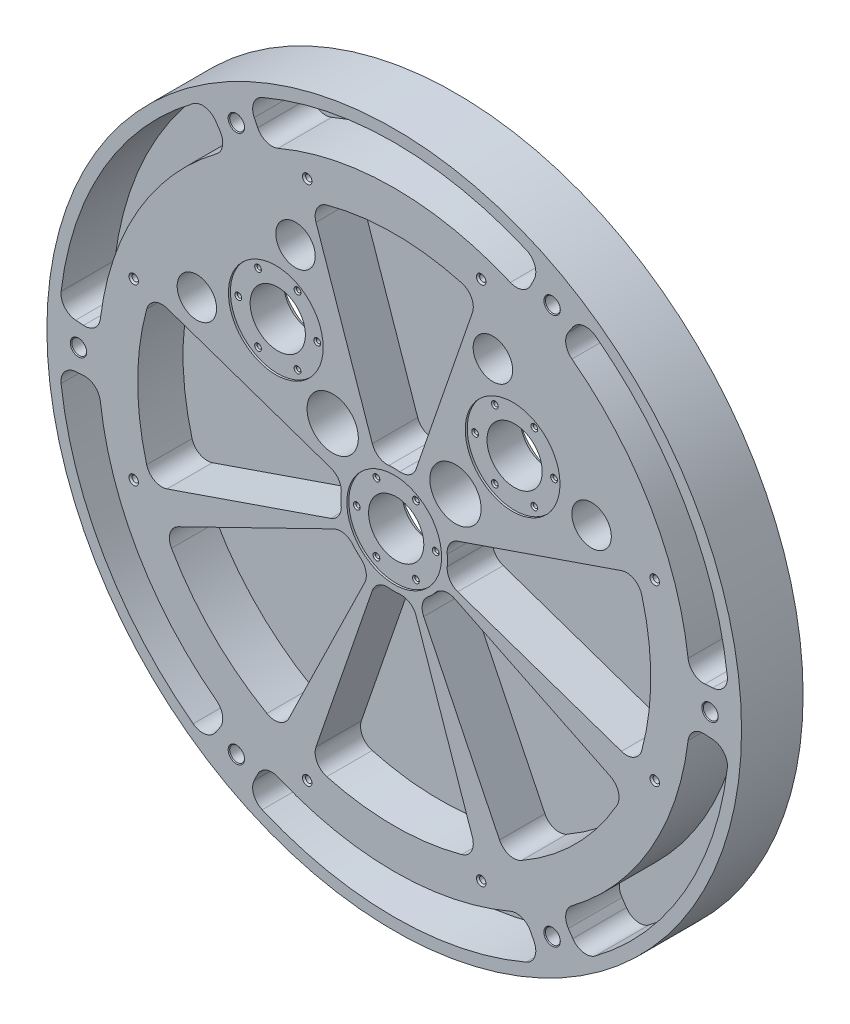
from build123d import *

# Parameters (mm, degrees)
SKETCH1_R                                 = 279.4
BOSS_EXTRUDE1_DEPTH                       = 50.8
SKETCH7_R                                 = 203.2
FDL_CART_RELEIF_DEPTH                     = 9.525
CENETER_SIGHT_THRU_HOLE_DEPTH             = 399.38343339
CENETER_SIGHT_THRU_HOLE_DEPTH_BACK        = 399.38343339
SKETCH9_R                                 = 22.225
SKETCH10_R                                = 38.1
CENTER_SIGHT_SPOT_FACE_DEPTH              = 1.5875
CENTER_SIGHT_BOLT_CIRCLE_D                = 3.4544
CENTER_SIGHT_BOLT_CIRCLE_DEPTH            = 14.837193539
CENTER_SIGHT_BOLT_CIRCLE_CSINK_D          = 5.4356
CENTER_SIGHT_BOLT_CIRCLE_CSINK_ANGLE      = 90
CENTER_SIGHT_BOLT_CIRCLE_TIP              = 1.037806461
SKETCH32_R                                = 22.225
UPPER_SIGHT_THRU_HOLES_DEPTH              = 399.38343339
SKETCH33_R                                = 38.1
UPPER_SIGHT_SPOT_FACE_DEPTH               = 1.5875
PERIMETER_POCKETS_DEPTH                   = 43.18
SKETCH44_R                                = 20.6375
INNER_CIRCLE_CUTS_DEPTH                   = 38.1
BACK_START                                = -12.7
SKETCH45_R                                = 38.1
BACK_WINDOW_POCKETING_DEPTH               = 12.7
F_1_4_20_HANDLE_HOLES_PLACE_1_D           = 5.1054
F_1_4_20_HANDLE_HOLES_PLACE_1_DEPTH       = 14.468183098
F_1_4_20_HANDLE_HOLES_PLACE_1_CSINK_D     = 7.62
F_1_4_20_HANDLE_HOLES_PLACE_1_CSINK_ANGLE = 90
F_1_4_20_HANDLE_HOLES_PLACE_1_TIP         = 1.533816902
F_1_4_20_HANDLE_HOLES_PLACE_3_D           = 5.1054
F_1_4_20_HANDLE_HOLES_PLACE_3_DEPTH       = 14.976183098
F_1_4_20_HANDLE_HOLES_PLACE_3_CSINK_D     = 7.62
F_1_4_20_HANDLE_HOLES_PLACE_3_CSINK_ANGLE = 90
F_1_4_20_HANDLE_HOLES_PLACE_3_TIP         = 1.533816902
SKETCH52_R                                = 398.165433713
CUT_EXTRUDE5_DEPTH                        = 3.175
F_8_32_TAPPED_HOLE1_D                     = 3.4544
F_8_32_TAPPED_HOLE1_DEPTH                 = 14.964193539
F_8_32_TAPPED_HOLE1_CSINK_D               = 5.4356
F_8_32_TAPPED_HOLE1_CSINK_ANGLE           = 90
F_8_32_TAPPED_HOLE1_TIP                   = 1.037806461
F_8_32_TAPPED_HOLE2_D                     = 3.4544
F_8_32_TAPPED_HOLE2_DEPTH                 = 14.964193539
F_8_32_TAPPED_HOLE2_CSINK_D               = 5.4356
F_8_32_TAPPED_HOLE2_CSINK_ANGLE           = 90
F_8_32_TAPPED_HOLE2_TIP                   = 1.037806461
LARGE_PEDALS_DEPTH                        = 36.5125
SKETCH63_R                                = 15.875
CUT_EXTRUDE9_DEPTH                        = 38.1
BOSS_EXTRUDE2_START                       = 1.905
SKETCH65_R                                = 279.4
SKETCH65_R_2                              = 203.2
BOSS_EXTRUDE2_DEPTH                       = 1.905
F_15_32_0_46875_DIAMETER_HOLE1_AT_2_COUNT = 2
F_15_32_0_46875_DIAMETER_HOLE1_AT_2_PITCH = 254
F_15_32_0_46875_DIAMETER_HOLE1_AT_3_COUNT = 2
F_15_32_0_46875_DIAMETER_HOLE1_AT_3_PITCH = 439.940905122
F_15_32_0_46875_DIAMETER_HOLE1_AT_4_COUNT = 2
F_15_32_0_46875_DIAMETER_HOLE1_AT_4_PITCH = 508
F_15_32_0_46875_DIAMETER_HOLE1_AT_5_COUNT = 2
F_15_32_0_46875_DIAMETER_HOLE1_AT_5_PITCH = 439.940905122
F_15_32_0_46875_DIAMETER_HOLE1_AT_6_COUNT = 2
F_15_32_0_46875_DIAMETER_HOLE1_AT_6_PITCH = 254


with BuildPart() as part:
    # Sketch1 → Boss-Extrude1 (new body)
    with BuildSketch(Plane.XY):
        Circle(SKETCH1_R)
    extrude(amount=BOSS_EXTRUDE1_DEPTH)

    # Sketch7 → FDL Cart Releif (cut)
    with BuildSketch(Plane(origin=(0, 0, 0), x_dir=(-1, 0, 0), z_dir=(0, 0, -1))):
        Circle(SKETCH7_R)
    extrude(amount=-FDL_CART_RELEIF_DEPTH, mode=Mode.SUBTRACT)

    # Sketch9 → ceneter sight thru hole (cut, two sides: drawn at the far end of the back side and taken through both)
    with BuildSketch(Plane.XY.offset(50.8).offset(-CENETER_SIGHT_THRU_HOLE_DEPTH_BACK)):
        Circle(SKETCH9_R)
    extrude(amount=CENETER_SIGHT_THRU_HOLE_DEPTH + CENETER_SIGHT_THRU_HOLE_DEPTH_BACK, mode=Mode.SUBTRACT)

    # Sketch10 → center sight spot face (cut)
    with BuildSketch(Plane.XY.offset(50.8)):
        Circle(SKETCH10_R)
    extrude(amount=-CENTER_SIGHT_SPOT_FACE_DEPTH, mode=Mode.SUBTRACT)

    # center sight bolt circle
    with Locations(Plane.XY.offset(49.2125)):
        with Locations((31.75, 0), (15.875, -27.49630657), (-15.875, -27.49630657), (-31.75, 0), (-15.875, 27.49630657), (15.875, 27.49630657)):
            CounterSinkHole(CENTER_SIGHT_BOLT_CIRCLE_D / 2, CENTER_SIGHT_BOLT_CIRCLE_CSINK_D / 2, depth=CENTER_SIGHT_BOLT_CIRCLE_DEPTH, counter_sink_angle=CENTER_SIGHT_BOLT_CIRCLE_CSINK_ANGLE)
            with Locations((0, 0, -(CENTER_SIGHT_BOLT_CIRCLE_DEPTH + CENTER_SIGHT_BOLT_CIRCLE_TIP / 2))):  # 118° drill point
                Cone(0, CENTER_SIGHT_BOLT_CIRCLE_D / 2, CENTER_SIGHT_BOLT_CIRCLE_TIP, mode=Mode.SUBTRACT)

    # Sketch32 → upper sight thru holes (cut, through all)
    with BuildSketch(Plane.XY.offset(50.8)):
        with Locations((-95.25, 98.425)):
            Circle(SKETCH32_R)
        with Locations((95.25, 98.425)):
            Circle(SKETCH32_R)
    extrude(amount=-UPPER_SIGHT_THRU_HOLES_DEPTH, mode=Mode.SUBTRACT)

    # Sketch33 → upper sight spot face (cut)
    with BuildSketch(Plane.XY.offset(50.8)):
        with Locations((-95.25, 98.425)):
            Circle(SKETCH33_R)
        with Locations((95.25, 98.425)):
            Circle(SKETCH33_R)
    extrude(amount=-UPPER_SIGHT_SPOT_FACE_DEPTH, mode=Mode.SUBTRACT)

    # Sketch38 → Perimeter Pockets (cut)
    with BuildSketch(Plane.XY.offset(50.8)):
        with BuildLine():
            Line((-109.813407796, 225.15085186), (-112.600551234, 230.865342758))
            ThreePointArc((-112.600551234, 230.865342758), (-113.088166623, 240.862696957), (-106.182699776, 248.108343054))
            ThreePointArc((-106.182699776, 248.108343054), (0, 269.875), (106.182699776, 248.108343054))
            ThreePointArc((106.182699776, 248.108343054), (113.088166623, 240.862696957), (112.600551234, 230.865342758))
            Line((112.600551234, 230.865342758), (109.813407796, 225.15085186))
            ThreePointArc((109.813407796, 225.15085186), (102.836212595, 218.818640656), (93.416509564, 219.036232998))
            ThreePointArc((93.416509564, 219.036232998), (0, 238.125), (-93.416509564, 219.036232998))
            ThreePointArc((-93.416509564, 219.036232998), (-102.836212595, 218.818640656), (-109.813407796, 225.15085186))
        make_face()
        with BuildLine():
            Line((140.079653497, 207.676626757), (143.634976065, 212.947609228))
            ThreePointArc((143.634976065, 212.947609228), (152.049131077, 218.368573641), (161.776778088, 216.011086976))
            ThreePointArc((161.776778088, 216.011086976), (233.718605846, 134.9375), (267.959477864, 32.097256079))
            ThreePointArc((267.959477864, 32.097256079), (265.1372977, 22.494123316), (256.235527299, 17.917733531))
            Line((256.235527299, 17.917733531), (249.893061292, 17.474225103))
            ThreePointArc((249.893061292, 17.474225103), (240.920607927, 20.350547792), (236.399196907, 28.617046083))
            ThreePointArc((236.399196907, 28.617046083), (206.222299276, 119.0625), (142.982687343, 190.419186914))
            ThreePointArc((142.982687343, 190.419186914), (138.084395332, 198.468092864), (140.079653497, 207.676626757))
        make_face()
        with BuildLine():
            Line((249.893061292, -17.474225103), (256.235527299, -17.917733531))
            ThreePointArc((256.235527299, -17.917733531), (265.1372977, -22.494123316), (267.959477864, -32.097256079))
            ThreePointArc((267.959477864, -32.097256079), (233.718605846, -134.9375), (161.776778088, -216.011086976))
            ThreePointArc((161.776778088, -216.011086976), (152.049131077, -218.368573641), (143.634976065, -212.947609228))
            Line((143.634976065, -212.947609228), (140.079653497, -207.676626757))
            ThreePointArc((140.079653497, -207.676626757), (138.084395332, -198.468092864), (142.982687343, -190.419186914))
            ThreePointArc((142.982687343, -190.419186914), (206.222299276, -119.0625), (236.399196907, -28.617046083))
            ThreePointArc((236.399196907, -28.617046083), (240.920607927, -20.350547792), (249.893061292, -17.474225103))
        make_face()
        with BuildLine():
            Line((109.813407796, -225.15085186), (112.600551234, -230.865342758))
            ThreePointArc((112.600551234, -230.865342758), (113.088166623, -240.862696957), (106.182699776, -248.108343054))
            ThreePointArc((106.182699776, -248.108343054), (0, -269.875), (-106.182699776, -248.108343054))
            ThreePointArc((-106.182699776, -248.108343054), (-113.088166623, -240.862696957), (-112.600551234, -230.865342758))
            Line((-112.600551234, -230.865342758), (-109.813407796, -225.15085186))
            ThreePointArc((-109.813407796, -225.15085186), (-102.836212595, -218.818640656), (-93.416509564, -219.036232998))
            ThreePointArc((-93.416509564, -219.036232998), (0, -238.125), (93.416509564, -219.036232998))
            ThreePointArc((93.416509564, -219.036232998), (102.836212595, -218.818640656), (109.813407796, -225.15085186))
        make_face()
        with BuildLine():
            Line((-140.079653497, -207.676626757), (-143.634976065, -212.947609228))
            ThreePointArc((-143.634976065, -212.947609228), (-152.049131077, -218.368573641), (-161.776778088, -216.011086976))
            ThreePointArc((-161.776778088, -216.011086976), (-233.718605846, -134.9375), (-267.959477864, -32.097256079))
            ThreePointArc((-267.959477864, -32.097256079), (-265.1372977, -22.494123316), (-256.235527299, -17.917733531))
            Line((-256.235527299, -17.917733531), (-249.893061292, -17.474225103))
            ThreePointArc((-249.893061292, -17.474225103), (-240.920607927, -20.350547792), (-236.399196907, -28.617046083))
            ThreePointArc((-236.399196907, -28.617046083), (-206.222299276, -119.0625), (-142.982687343, -190.419186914))
            ThreePointArc((-142.982687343, -190.419186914), (-138.084395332, -198.468092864), (-140.079653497, -207.676626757))
        make_face()
        with BuildLine():
            Line((-249.893061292, 17.474225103), (-256.235527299, 17.917733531))
            ThreePointArc((-256.235527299, 17.917733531), (-265.1372977, 22.494123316), (-267.959477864, 32.097256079))
            ThreePointArc((-267.959477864, 32.097256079), (-233.718605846, 134.9375), (-161.776778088, 216.011086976))
            ThreePointArc((-161.776778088, 216.011086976), (-152.049131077, 218.368573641), (-143.634976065, 212.947609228))
            Line((-143.634976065, 212.947609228), (-140.079653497, 207.676626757))
            ThreePointArc((-140.079653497, 207.676626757), (-138.084395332, 198.468092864), (-142.982687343, 190.419186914))
            ThreePointArc((-142.982687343, 190.419186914), (-206.222299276, 119.0625), (-236.399196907, 28.617046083))
            ThreePointArc((-236.399196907, 28.617046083), (-240.920607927, 20.350547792), (-249.893061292, 17.474225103))
        make_face()
    extrude(amount=-PERIMETER_POCKETS_DEPTH, mode=Mode.SUBTRACT)

    # Sketch44 → Inner circle Cuts (cut)
    with BuildSketch(Plane.XY.offset(50.8)):
        with Locations((-49.492310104, 49.290300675)):
            Circle(SKETCH44_R)
        with Locations((49.290300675, 49.492310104)):
            Circle(SKETCH44_R)
    extrude(amount=-INNER_CIRCLE_CUTS_DEPTH, mode=Mode.SUBTRACT)

    # Sketch45 → Back Window Pocketing (cut)
    with BuildSketch(Plane(origin=(0, 0, 9.525), x_dir=(-1, 0, 0), z_dir=(0, 0, -1)).offset(BACK_START)):
        with Locations(Location((-95.25, 98.425, 0), (0, 0, 180))):
            Circle(SKETCH45_R)
        with Locations(Location((95.25, 98.425, 0), (0, 0, 180))):
            Circle(SKETCH45_R)
        with Locations(Location((0, 0, 0), (0, 0, 180))):
            Circle(SKETCH45_R)
    extrude(amount=BACK_WINDOW_POCKETING_DEPTH, mode=Mode.SUBTRACT)

    # 1_4-20 Handle Holes Place 1
    with Locations(Plane.XY.offset(50.8)):
        with Locations((-209.55, 69.977), (-209.55, -69.977), (209.55, -69.977), (209.55, 69.977)):
            CounterSinkHole(F_1_4_20_HANDLE_HOLES_PLACE_1_D / 2, F_1_4_20_HANDLE_HOLES_PLACE_1_CSINK_D / 2, depth=F_1_4_20_HANDLE_HOLES_PLACE_1_DEPTH, counter_sink_angle=F_1_4_20_HANDLE_HOLES_PLACE_1_CSINK_ANGLE)
            with Locations((0, 0, -(F_1_4_20_HANDLE_HOLES_PLACE_1_DEPTH + F_1_4_20_HANDLE_HOLES_PLACE_1_TIP / 2))):  # 118° drill point
                Cone(0, F_1_4_20_HANDLE_HOLES_PLACE_1_D / 2, F_1_4_20_HANDLE_HOLES_PLACE_1_TIP, mode=Mode.SUBTRACT)

    # 1_4-20 Handle Holes Place 3
    with Locations(Plane.XY.offset(50.8)):
        with Locations((-69.977, 209.55), (69.977, 209.55), (69.977, -209.55), (-69.977, -209.55)):
            CounterSinkHole(F_1_4_20_HANDLE_HOLES_PLACE_3_D / 2, F_1_4_20_HANDLE_HOLES_PLACE_3_CSINK_D / 2, depth=F_1_4_20_HANDLE_HOLES_PLACE_3_DEPTH, counter_sink_angle=F_1_4_20_HANDLE_HOLES_PLACE_3_CSINK_ANGLE)
            with Locations((0, 0, -(F_1_4_20_HANDLE_HOLES_PLACE_3_DEPTH + F_1_4_20_HANDLE_HOLES_PLACE_3_TIP / 2))):  # 118° drill point
                Cone(0, F_1_4_20_HANDLE_HOLES_PLACE_3_D / 2, F_1_4_20_HANDLE_HOLES_PLACE_3_TIP, mode=Mode.SUBTRACT)

    # Sketch52 → Cut-Extrude5 (cut)
    with BuildSketch(Plane(origin=(0, 0, 0), x_dir=(-1, 0, 0), z_dir=(0, 0, -1))):
        Circle(SKETCH52_R)
    extrude(amount=-CUT_EXTRUDE5_DEPTH, mode=Mode.SUBTRACT)

    # 8-32 Tapped Hole1
    with Locations(Plane.XY.offset(49.2125)):
        with Locations((-127, 98.425), (-95.25, 98.425), (-111.125, 125.92130657), (-79.375, 125.92130657), (-63.5, 98.425), (-79.375, 70.92869343), (-111.125, 70.92869343)):
            CounterSinkHole(F_8_32_TAPPED_HOLE1_D / 2, F_8_32_TAPPED_HOLE1_CSINK_D / 2, depth=F_8_32_TAPPED_HOLE1_DEPTH, counter_sink_angle=F_8_32_TAPPED_HOLE1_CSINK_ANGLE)
            with Locations((0, 0, -(F_8_32_TAPPED_HOLE1_DEPTH + F_8_32_TAPPED_HOLE1_TIP / 2))):  # 118° drill point
                Cone(0, F_8_32_TAPPED_HOLE1_D / 2, F_8_32_TAPPED_HOLE1_TIP, mode=Mode.SUBTRACT)

    # 8-32 Tapped Hole2
    with Locations(Plane.XY.offset(49.2125)):
        with Locations((63.5, 98.425), (95.25, 98.425), (79.375, 125.92130657), (111.125, 125.92130657), (127, 98.425), (111.125, 70.92869343), (79.375, 70.92869343)):
            CounterSinkHole(F_8_32_TAPPED_HOLE2_D / 2, F_8_32_TAPPED_HOLE2_CSINK_D / 2, depth=F_8_32_TAPPED_HOLE2_DEPTH, counter_sink_angle=F_8_32_TAPPED_HOLE2_CSINK_ANGLE)
            with Locations((0, 0, -(F_8_32_TAPPED_HOLE2_DEPTH + F_8_32_TAPPED_HOLE2_TIP / 2))):  # 118° drill point
                Cone(0, F_8_32_TAPPED_HOLE2_D / 2, F_8_32_TAPPED_HOLE2_TIP, mode=Mode.SUBTRACT)

    # Sketch62 → Large Pedals (cut)
    with BuildSketch(Plane.XY.offset(50.8)):
        with BuildLine():
            Line((-17.610503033, 51.144614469), (-62.918701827, 182.729178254))
            ThreePointArc((-62.918701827, 182.729178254), (-62.136523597, 192.802664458), (-54.24901696, 199.117263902))
            ThreePointArc((-54.24901696, 199.117263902), (0, 206.375), (54.24901696, 199.117263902))
            ThreePointArc((54.24901696, 199.117263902), (62.136523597, 192.802664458), (62.918701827, 182.729178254))
            Line((62.918701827, 182.729178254), (17.610503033, 51.144614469))
            ThreePointArc((17.610503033, 51.144614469), (12.446017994, 44.580959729), (4.321864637, 42.644054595))
            ThreePointArc((4.321864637, 42.644054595), (0, 42.8625), (-4.321864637, 42.644054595))
            ThreePointArc((-4.321864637, 42.644054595), (-12.446017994, 44.580959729), (-17.610503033, 51.144614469))
        make_face()
        with BuildLine():
            Line((51.144614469, 17.610503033), (182.729178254, 62.918701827))
            ThreePointArc((182.729178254, 62.918701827), (192.802664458, 62.136523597), (199.117263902, 54.24901696))
            ThreePointArc((199.117263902, 54.24901696), (206.375, 0), (199.117263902, -54.24901696))
            ThreePointArc((199.117263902, -54.24901696), (192.802664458, -62.136523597), (182.729178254, -62.918701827))
            Line((182.729178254, -62.918701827), (51.144614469, -17.610503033))
            ThreePointArc((51.144614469, -17.610503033), (44.580959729, -12.446017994), (42.644054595, -4.321864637))
            ThreePointArc((42.644054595, -4.321864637), (42.8625, 0), (42.644054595, 4.321864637))
            ThreePointArc((42.644054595, 4.321864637), (44.580959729, 12.446017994), (51.144614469, 17.610503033))
        make_face()
        with BuildLine():
            Line((48.617209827, -23.712197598), (173.699281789, -84.718800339))
            ThreePointArc((173.699281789, -84.718800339), (180.269228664, -92.394914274), (179.157015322, -102.437319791))
            ThreePointArc((179.157015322, -102.437319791), (145.929161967, -145.929161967), (102.437319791, -179.157015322))
            ThreePointArc((102.437319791, -179.157015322), (92.394914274, -180.269228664), (84.718800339, -173.699281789))
            Line((84.718800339, -173.699281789), (23.712197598, -48.617209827))
            ThreePointArc((23.712197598, -48.617209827), (22.722835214, -40.324162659), (27.097880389, -33.209919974))
            ThreePointArc((27.097880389, -33.209919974), (30.308364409, -30.308364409), (33.209919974, -27.097880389))
            ThreePointArc((33.209919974, -27.097880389), (40.324162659, -22.722835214), (48.617209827, -23.712197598))
        make_face()
        with BuildLine():
            Line((17.610503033, -51.144614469), (62.918701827, -182.729178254))
            ThreePointArc((62.918701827, -182.729178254), (62.136523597, -192.802664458), (54.24901696, -199.117263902))
            ThreePointArc((54.24901696, -199.117263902), (0, -206.375), (-54.24901696, -199.117263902))
            ThreePointArc((-54.24901696, -199.117263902), (-62.136523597, -192.802664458), (-62.918701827, -182.729178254))
            Line((-62.918701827, -182.729178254), (-17.610503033, -51.144614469))
            ThreePointArc((-17.610503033, -51.144614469), (-12.446017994, -44.580959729), (-4.321864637, -42.644054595))
            ThreePointArc((-4.321864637, -42.644054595), (0, -42.8625), (4.321864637, -42.644054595))
            ThreePointArc((4.321864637, -42.644054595), (12.446017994, -44.580959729), (17.610503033, -51.144614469))
        make_face()
        with BuildLine():
            Line((-23.712197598, -48.617209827), (-84.718800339, -173.699281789))
            ThreePointArc((-84.718800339, -173.699281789), (-92.394914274, -180.269228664), (-102.437319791, -179.157015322))
            ThreePointArc((-102.437319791, -179.157015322), (-145.929161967, -145.929161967), (-179.157015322, -102.437319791))
            ThreePointArc((-179.157015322, -102.437319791), (-180.269228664, -92.394914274), (-173.699281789, -84.718800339))
            Line((-173.699281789, -84.718800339), (-48.617209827, -23.712197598))
            ThreePointArc((-48.617209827, -23.712197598), (-40.324162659, -22.722835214), (-33.209919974, -27.097880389))
            ThreePointArc((-33.209919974, -27.097880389), (-30.308364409, -30.308364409), (-27.097880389, -33.209919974))
            ThreePointArc((-27.097880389, -33.209919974), (-22.722835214, -40.324162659), (-23.712197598, -48.617209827))
        make_face()
        with BuildLine():
            Line((-51.144614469, -17.610503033), (-182.729178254, -62.918701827))
            ThreePointArc((-182.729178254, -62.918701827), (-192.802664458, -62.136523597), (-199.117263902, -54.24901696))
            ThreePointArc((-199.117263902, -54.24901696), (-206.375, 0), (-199.117263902, 54.24901696))
            ThreePointArc((-199.117263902, 54.24901696), (-192.802664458, 62.136523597), (-182.729178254, 62.918701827))
            Line((-182.729178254, 62.918701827), (-51.144614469, 17.610503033))
            ThreePointArc((-51.144614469, 17.610503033), (-44.580959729, 12.446017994), (-42.644054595, 4.321864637))
            ThreePointArc((-42.644054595, 4.321864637), (-42.8625, 0), (-42.644054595, -4.321864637))
            ThreePointArc((-42.644054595, -4.321864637), (-44.580959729, -12.446017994), (-51.144614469, -17.610503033))
        make_face()
    extrude(amount=-LARGE_PEDALS_DEPTH, mode=Mode.SUBTRACT)

    # Sketch63 → Cut-Extrude9 (cut)
    with BuildSketch(Plane.XY.offset(50.8)):
        with Locations((-79.375, 158.75)):
            Circle(SKETCH63_R)
        with Locations((-158.75, 82.55)):
            Circle(SKETCH63_R)
        with Locations(Location((79.375, 158.75, 0), (0, 0, 180))):
            Circle(SKETCH63_R)
        with Locations(Location((158.75, 82.55, 0), (0, 0, 180))):
            Circle(SKETCH63_R)
    extrude(amount=-CUT_EXTRUDE9_DEPTH, mode=Mode.SUBTRACT)

    # Sketch65 → Boss-Extrude2 (add)
    with BuildSketch(Plane(origin=(0, 0, 3.175), x_dir=(-1, 0, 0), z_dir=(0, 0, -1)).offset(BOSS_EXTRUDE2_START)):
        Circle(SKETCH65_R)
        Circle(SKETCH65_R_2, mode=Mode.SUBTRACT)
    extrude(amount=-BOSS_EXTRUDE2_DEPTH)

    # Sketch67 → 15_32 _0.46875_ Diameter Hole1 (revolve, cut)
    with BuildSketch(Plane(origin=(-254, 0, 50.8), x_dir=(0, -1, 0), z_dir=(1, 0, 0))):
        Polygon((0, 0), (0, 49.53), (6.588125, 49.53), (5.953125, 48.895), (5.953125, 0.635), (6.588125, 0), align=None)
    f_15_32_0_46875_diameter_hole1 = revolve(axis=Axis((-254, 0, 57.15), (0, 0, -1)), mode=Mode.SUBTRACT)

    # 15_32 _0.46875_ Diameter Hole1 at 2: 15_32 _0.46875_ Diameter Hole1 ×2
    with Locations(*[Vector(0.500000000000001, 0.8660254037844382, 0) * (i * F_15_32_0_46875_DIAMETER_HOLE1_AT_2_PITCH) for i in range(1, F_15_32_0_46875_DIAMETER_HOLE1_AT_2_COUNT)]):
        add(f_15_32_0_46875_diameter_hole1, mode=Mode.SUBTRACT)

    # 15_32 _0.46875_ Diameter Hole1 at 3: 15_32 _0.46875_ Diameter Hole1 ×2
    with Locations(*[Vector(0.8660254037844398, 0.499999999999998, 0) * (i * F_15_32_0_46875_DIAMETER_HOLE1_AT_3_PITCH) for i in range(1, F_15_32_0_46875_DIAMETER_HOLE1_AT_3_COUNT)]):
        add(f_15_32_0_46875_diameter_hole1, mode=Mode.SUBTRACT)

    # 15_32 _0.46875_ Diameter Hole1 at 4: 15_32 _0.46875_ Diameter Hole1 ×2
    with Locations(*[(i * F_15_32_0_46875_DIAMETER_HOLE1_AT_4_PITCH, 0, 0) for i in range(1, F_15_32_0_46875_DIAMETER_HOLE1_AT_4_COUNT)]):
        add(f_15_32_0_46875_diameter_hole1, mode=Mode.SUBTRACT)

    # 15_32 _0.46875_ Diameter Hole1 at 5: 15_32 _0.46875_ Diameter Hole1 ×2
    with Locations(*[Vector(0.8660254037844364, -0.500000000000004, 0) * (i * F_15_32_0_46875_DIAMETER_HOLE1_AT_5_PITCH) for i in range(1, F_15_32_0_46875_DIAMETER_HOLE1_AT_5_COUNT)]):
        add(f_15_32_0_46875_diameter_hole1, mode=Mode.SUBTRACT)

    # 15_32 _0.46875_ Diameter Hole1 at 6: 15_32 _0.46875_ Diameter Hole1 ×2
    with Locations(*[Vector(0.4999999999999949, -0.8660254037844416, 0) * (i * F_15_32_0_46875_DIAMETER_HOLE1_AT_6_PITCH) for i in range(1, F_15_32_0_46875_DIAMETER_HOLE1_AT_6_COUNT)]):
        add(f_15_32_0_46875_diameter_hole1, mode=Mode.SUBTRACT)


solid = part.part
